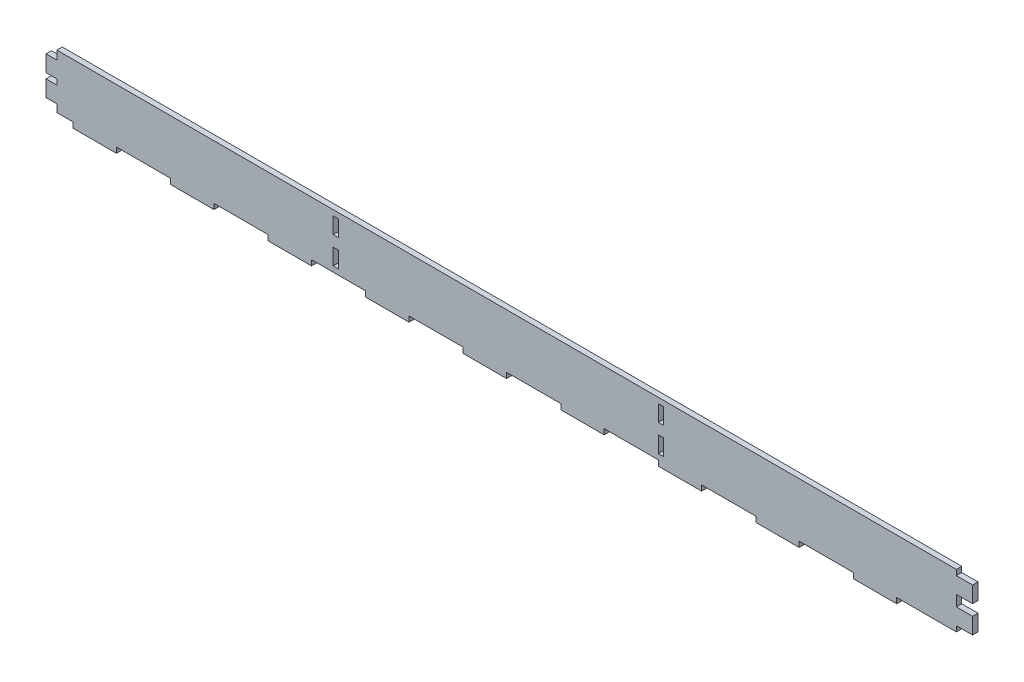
from build123d import *

# Parameters (mm, degrees)
MODEL_W             = 5
MODEL_H             = 15
BOSS_EXTRUDE1_DEPTH = 5
CUT_EXTRUDE1_DEPTH  = 902.401686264


with BuildPart() as part:
    # Model → Boss-Extrude1 (new body)
    with BuildSketch(Plane.XY):
        Polygon((-885, 0), (-830, 0), (-830, -5), (-790, -5), (-790, 0), (-740, 0), (-740, -5), (-700, -5), (-700, 0), (-650, 0), (-650, -5), (-610, -5), (-610, 0), (-560, 0), (-560, -5), (-520, -5), (-520, 0), (-470, 0), (-470, -5), (-430, -5), (-430, 0), (-380, 0), (-380, -5), (-340, -5), (-340, 0), (-290, 0), (-290, -5), (-250, -5), (-250, 0), (-200, 0), (-200, -5), (-160, -5), (-160, 0), (-110, 0), (-110, -5), (-70, -5), (-70, 0), (-20, 0), (-20, -5), (20, -5), (20, 0), (70, 0), (70, -5), (110, -5), (110, 0), (160, 0), (160, -5), (200, -5), (200, 0), (250, 0), (250, -5), (290, -5), (290, 0), (340, 0), (340, -5), (380, -5), (380, 0), (430, 0), (430, -5), (470, -5), (470, 0), (520, 0), (520, -5), (560, -5), (560, 0), (610, 0), (610, -5), (650, -5), (650, 0), (700, 0), (700, -5), (740, -5), (740, 0), (790, 0), (790, -5), (830, -5), (830, 0), (885, 0), (885, 5), (900, 5), (900, 20), (885, 20), (885, 30), (900, 30), (900, 45), (885, 45), (885, 50), (-885, 50), (-885, 45), (-900, 45), (-900, 30), (-885, 30), (-885, 20), (-900, 20), (-900, 5), (-885, 5), align=None)
        with Locations((-587.5, 12.5)):
            Rectangle(MODEL_W, MODEL_H, mode=Mode.SUBTRACT)
        with Locations((612.5, 12.5)):
            Rectangle(MODEL_W, MODEL_H, mode=Mode.SUBTRACT)
        with Locations((-587.5, 37.5)):
            Rectangle(MODEL_W, MODEL_H, mode=Mode.SUBTRACT)
        with Locations((612.5, 37.5)):
            Rectangle(MODEL_W, MODEL_H, mode=Mode.SUBTRACT)
        with Locations((312.5, 12.5)):
            Rectangle(MODEL_W, MODEL_H, mode=Mode.SUBTRACT)
        with Locations((312.5, 37.5)):
            Rectangle(MODEL_W, MODEL_H, mode=Mode.SUBTRACT)
        with Locations((12.5, 12.5)):
            Rectangle(MODEL_W, MODEL_H, mode=Mode.SUBTRACT)
        with Locations((12.5, 37.5)):
            Rectangle(MODEL_W, MODEL_H, mode=Mode.SUBTRACT)
        with Locations((-287.5, 12.5)):
            Rectangle(MODEL_W, MODEL_H, mode=Mode.SUBTRACT)
        with Locations((-287.5, 37.5)):
            Rectangle(MODEL_W, MODEL_H, mode=Mode.SUBTRACT)
    extrude(amount=BOSS_EXTRUDE1_DEPTH)

    # Sketch1 → Cut-Extrude1 (cut, through all)
    with BuildSketch(Plane.XY.offset(5)):
        Polygon((55, 50), (55, 42), (45, 42), (45, 27), (55, 27), (55, 22), (45, 22), (45, 7), (55, 7), (55, 0), (-782.74381087, -337.857910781), (-1184.219306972, 174.472759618), align=None)
    extrude(amount=-CUT_EXTRUDE1_DEPTH, mode=Mode.SUBTRACT)


solid = part.part
